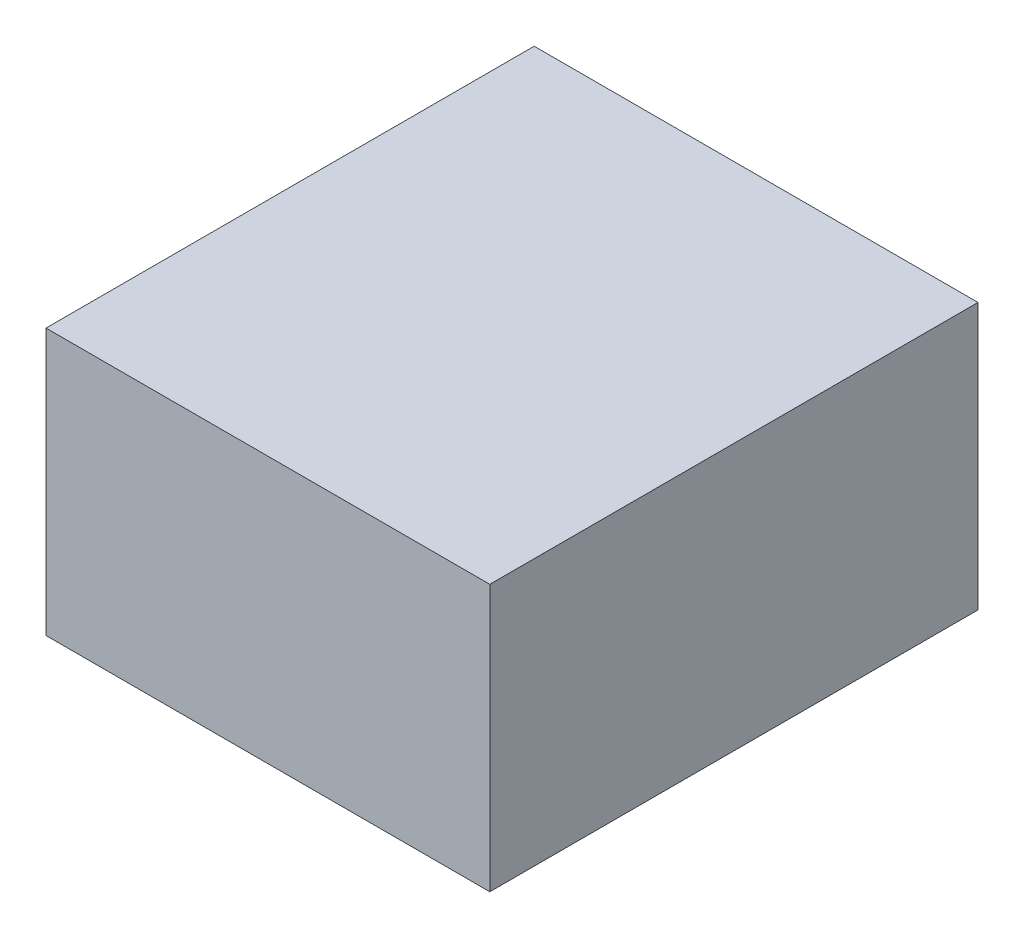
ISO-10303-21;
HEADER;
FILE_DESCRIPTION(('STEP AP214'),'2;1');
FILE_NAME('part.step','',(''),(''),'','','');
FILE_SCHEMA(('AUTOMOTIVE_DESIGN { 1 0 10303 214 1 1 1 1 }'));
ENDSEC;
DATA;
#1=APPLICATION_CONTEXT('core data for automotive mechanical design processes');
#2=APPLICATION_PROTOCOL_DEFINITION('international standard','automotive_design',2000,#1);
#3=PRODUCT_CONTEXT('',#1,'mechanical');
#4=PRODUCT('Part','Part','',(#3));
#5=PRODUCT_RELATED_PRODUCT_CATEGORY('part','',(#4));
#6=PRODUCT_DEFINITION_FORMATION('','',#4);
#7=PRODUCT_DEFINITION_CONTEXT('part definition',#1,'design');
#8=PRODUCT_DEFINITION('design','',#6,#7);
#9=PRODUCT_DEFINITION_SHAPE('','',#8);
#10=(LENGTH_UNIT() NAMED_UNIT(*) SI_UNIT(.MILLI.,.METRE.));
#11=(NAMED_UNIT(*) PLANE_ANGLE_UNIT() SI_UNIT($,.RADIAN.));
#12=(NAMED_UNIT(*) SI_UNIT($,.STERADIAN.) SOLID_ANGLE_UNIT());
#13=UNCERTAINTY_MEASURE_WITH_UNIT(LENGTH_MEASURE(1.E-05),#10,'distance_accuracy_value','');
#14=(GEOMETRIC_REPRESENTATION_CONTEXT(3) GLOBAL_UNCERTAINTY_ASSIGNED_CONTEXT((#13)) GLOBAL_UNIT_ASSIGNED_CONTEXT((#10,
#11,#12)) REPRESENTATION_CONTEXT('',''));
#15=CARTESIAN_POINT('',(0.,0.,0.));
#16=DIRECTION('',(0.,0.,1.));
#17=DIRECTION('',(1.,0.,0.));
#18=AXIS2_PLACEMENT_3D('',#15,#16,#17);
#19=CARTESIAN_POINT('',(0.,0.,0.5499989));
#20=DIRECTION('',(0.,0.,1.));
#21=DIRECTION('',(1.,0.,0.));
#22=AXIS2_PLACEMENT_3D('',#19,#20,#21);
#23=PLANE('',#22);
#24=DIRECTION('',(-1.,0.,0.));
#25=VECTOR('',#24,1.);
#26=CARTESIAN_POINT('',(0.2499995,0.1499997,0.5499989));
#27=LINE('',#26,#25);
#28=CARTESIAN_POINT('',(0.2499995,0.1499997,0.5499989));
#29=VERTEX_POINT('',#28);
#30=CARTESIAN_POINT('',(-0.2499995,0.1499997,0.5499989));
#31=VERTEX_POINT('',#30);
#32=EDGE_CURVE('E91',#29,#31,#27,.T.);
#33=ORIENTED_EDGE('',*,*,#32,.T.);
#34=DIRECTION('',(0.,-1.,0.));
#35=VECTOR('',#34,1.);
#36=CARTESIAN_POINT('',(-0.2499995,0.1499997,0.5499989));
#37=LINE('',#36,#35);
#38=CARTESIAN_POINT('',(-0.2499995,-0.1499997,0.5499989));
#39=VERTEX_POINT('',#38);
#40=EDGE_CURVE('E86',#31,#39,#37,.T.);
#41=ORIENTED_EDGE('',*,*,#40,.T.);
#42=DIRECTION('',(1.,0.,0.));
#43=VECTOR('',#42,1.);
#44=CARTESIAN_POINT('',(-0.2499995,-0.1499997,0.5499989));
#45=LINE('',#44,#43);
#46=CARTESIAN_POINT('',(0.2499995,-0.1499997,0.5499989));
#47=VERTEX_POINT('',#46);
#48=EDGE_CURVE('E114',#39,#47,#45,.T.);
#49=ORIENTED_EDGE('',*,*,#48,.T.);
#50=DIRECTION('',(0.,1.,0.));
#51=VECTOR('',#50,1.);
#52=CARTESIAN_POINT('',(0.2499995,-0.1499997,0.5499989));
#53=LINE('',#52,#51);
#54=EDGE_CURVE('E11',#47,#29,#53,.T.);
#55=ORIENTED_EDGE('',*,*,#54,.T.);
#56=EDGE_LOOP('',(#33,#41,#49,#55));
#57=FACE_BOUND('',#56,.T.);
#58=ADVANCED_FACE('F17',(#57),#23,.T.);
#59=CARTESIAN_POINT('',(0.,0.,0.));
#60=DIRECTION('',(0.,0.,1.));
#61=DIRECTION('',(1.,0.,0.));
#62=AXIS2_PLACEMENT_3D('',#59,#60,#61);
#63=PLANE('',#62);
#64=DIRECTION('',(0.,1.,0.));
#65=VECTOR('',#64,1.);
#66=CARTESIAN_POINT('',(0.2499995,-0.1499997,0.));
#67=LINE('',#66,#65);
#68=CARTESIAN_POINT('',(0.2499995,-0.1499997,0.));
#69=VERTEX_POINT('',#68);
#70=CARTESIAN_POINT('',(0.2499995,0.1499997,0.));
#71=VERTEX_POINT('',#70);
#72=EDGE_CURVE('E21',#69,#71,#67,.T.);
#73=ORIENTED_EDGE('',*,*,#72,.F.);
#74=DIRECTION('',(1.,0.,0.));
#75=VECTOR('',#74,1.);
#76=CARTESIAN_POINT('',(-0.2499995,-0.1499997,0.));
#77=LINE('',#76,#75);
#78=CARTESIAN_POINT('',(-0.2499995,-0.1499997,0.));
#79=VERTEX_POINT('',#78);
#80=EDGE_CURVE('E74',#79,#69,#77,.T.);
#81=ORIENTED_EDGE('',*,*,#80,.F.);
#82=DIRECTION('',(0.,-1.,0.));
#83=VECTOR('',#82,1.);
#84=CARTESIAN_POINT('',(-0.2499995,0.1499997,0.));
#85=LINE('',#84,#83);
#86=CARTESIAN_POINT('',(-0.2499995,0.1499997,0.));
#87=VERTEX_POINT('',#86);
#88=EDGE_CURVE('E69',#87,#79,#85,.T.);
#89=ORIENTED_EDGE('',*,*,#88,.F.);
#90=DIRECTION('',(-1.,0.,0.));
#91=VECTOR('',#90,1.);
#92=CARTESIAN_POINT('',(0.2499995,0.1499997,0.));
#93=LINE('',#92,#91);
#94=EDGE_CURVE('E72',#71,#87,#93,.T.);
#95=ORIENTED_EDGE('',*,*,#94,.F.);
#96=EDGE_LOOP('',(#73,#81,#89,#95));
#97=FACE_BOUND('',#96,.T.);
#98=ADVANCED_FACE('F19',(#97),#63,.F.);
#99=CARTESIAN_POINT('',(0.2499995,-0.1499997,0.));
#100=DIRECTION('',(-1.,0.,0.));
#101=DIRECTION('',(0.,0.,1.));
#102=AXIS2_PLACEMENT_3D('',#99,#100,#101);
#103=PLANE('',#102);
#104=ORIENTED_EDGE('',*,*,#72,.T.);
#105=DIRECTION('',(0.,0.,1.));
#106=VECTOR('',#105,1.);
#107=CARTESIAN_POINT('',(0.2499995,0.1499997,0.));
#108=LINE('',#107,#106);
#109=EDGE_CURVE('E80',#71,#29,#108,.T.);
#110=ORIENTED_EDGE('',*,*,#109,.T.);
#111=ORIENTED_EDGE('',*,*,#54,.F.);
#112=DIRECTION('',(0.,0.,1.));
#113=VECTOR('',#112,1.);
#114=CARTESIAN_POINT('',(0.2499995,-0.1499997,0.));
#115=LINE('',#114,#113);
#116=EDGE_CURVE('E111',#69,#47,#115,.T.);
#117=ORIENTED_EDGE('',*,*,#116,.F.);
#118=EDGE_LOOP('',(#104,#110,#111,#117));
#119=FACE_BOUND('',#118,.T.);
#120=ADVANCED_FACE('F122',(#119),#103,.F.);
#121=CARTESIAN_POINT('',(-0.2499995,-0.1499997,0.));
#122=DIRECTION('',(0.,1.,0.));
#123=DIRECTION('',(1.,0.,0.));
#124=AXIS2_PLACEMENT_3D('',#121,#122,#123);
#125=PLANE('',#124);
#126=ORIENTED_EDGE('',*,*,#80,.T.);
#127=ORIENTED_EDGE('',*,*,#116,.T.);
#128=ORIENTED_EDGE('',*,*,#48,.F.);
#129=DIRECTION('',(0.,0.,1.));
#130=VECTOR('',#129,1.);
#131=CARTESIAN_POINT('',(-0.2499995,-0.1499997,0.));
#132=LINE('',#131,#130);
#133=EDGE_CURVE('E79',#79,#39,#132,.T.);
#134=ORIENTED_EDGE('',*,*,#133,.F.);
#135=EDGE_LOOP('',(#126,#127,#128,#134));
#136=FACE_BOUND('',#135,.T.);
#137=ADVANCED_FACE('F124',(#136),#125,.F.);
#138=CARTESIAN_POINT('',(-0.2499995,0.1499997,0.));
#139=DIRECTION('',(1.,0.,0.));
#140=DIRECTION('',(0.,1.,0.));
#141=AXIS2_PLACEMENT_3D('',#138,#139,#140);
#142=PLANE('',#141);
#143=ORIENTED_EDGE('',*,*,#88,.T.);
#144=ORIENTED_EDGE('',*,*,#133,.T.);
#145=ORIENTED_EDGE('',*,*,#40,.F.);
#146=DIRECTION('',(0.,0.,1.));
#147=VECTOR('',#146,1.);
#148=CARTESIAN_POINT('',(-0.2499995,0.1499997,0.));
#149=LINE('',#148,#147);
#150=EDGE_CURVE('E83',#87,#31,#149,.T.);
#151=ORIENTED_EDGE('',*,*,#150,.F.);
#152=EDGE_LOOP('',(#143,#144,#145,#151));
#153=FACE_BOUND('',#152,.T.);
#154=ADVANCED_FACE('F84',(#153),#142,.F.);
#155=CARTESIAN_POINT('',(0.2499995,0.1499997,0.));
#156=DIRECTION('',(0.,-1.,0.));
#157=DIRECTION('',(0.,0.,-1.));
#158=AXIS2_PLACEMENT_3D('',#155,#156,#157);
#159=PLANE('',#158);
#160=ORIENTED_EDGE('',*,*,#94,.T.);
#161=ORIENTED_EDGE('',*,*,#150,.T.);
#162=ORIENTED_EDGE('',*,*,#32,.F.);
#163=ORIENTED_EDGE('',*,*,#109,.F.);
#164=EDGE_LOOP('',(#160,#161,#162,#163));
#165=FACE_BOUND('',#164,.T.);
#166=ADVANCED_FACE('F94',(#165),#159,.F.);
#167=CLOSED_SHELL('',(#58,#98,#120,#137,#154,#166));
#168=MANIFOLD_SOLID_BREP('B1',#167);
#169=ADVANCED_BREP_SHAPE_REPRESENTATION('',(#18,#168),#14);
#170=SHAPE_DEFINITION_REPRESENTATION(#9,#169);
ENDSEC;
END-ISO-10303-21;
